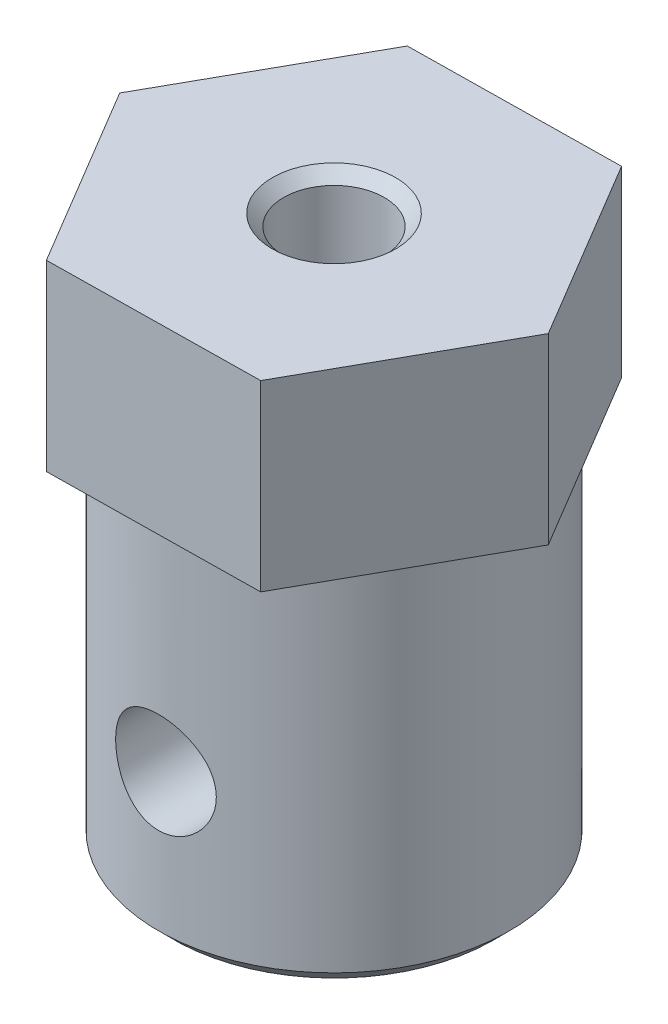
from build123d import *

# Parameters (mm, degrees)
SALIENTE_EXTRUIR1_DEPTH         = 6
TALADRO_ROSCADO_M41_D           = 3.3
TALADRO_ROSCADO_M41_CSINK_D     = 4.05
TALADRO_ROSCADO_M41_CSINK_ANGLE = 90
CROQUIS4_R                      = 5.75
CROQUIS4_R_2                    = 3
SALIENTE_EXTRUIR2_DEPTH         = 12
CHAFL_N1_SIZE                   = 0.5


with BuildPart() as part:
    # Croquis1 → Saliente-Extruir1 (new body)
    with BuildSketch(Plane(origin=(0, 0, 0), x_dir=(1, 0, 0), z_dir=(0, 1, 0))):
        Polygon((-3.547687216, 5.950959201), (-6.927525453, -0.096907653), (-3.379838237, -6.047866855), (3.547687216, -5.950959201), (6.927525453, 0.096907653), (3.379838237, 6.047866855), align=None)
    extrude(amount=SALIENTE_EXTRUIR1_DEPTH)

    # Taladro roscado M41 (through all)
    with Locations(Plane(origin=(0, 6, 0), x_dir=(1, 0, 0), z_dir=(0, 1, 0))):
        with Locations((0, 0)):
            CounterSinkHole(TALADRO_ROSCADO_M41_D / 2, TALADRO_ROSCADO_M41_CSINK_D / 2, counter_sink_angle=TALADRO_ROSCADO_M41_CSINK_ANGLE)

    # Croquis4 → Saliente-Extruir2 (add)
    with BuildSketch(Plane.XZ):
        with Locations(Location((0, 0, 0), (0, 0, 270))):
            Circle(CROQUIS4_R)
        with Locations(Location((0, 0, 0), (0, 0, 270))):
            Circle(CROQUIS4_R_2, mode=Mode.SUBTRACT)
    extrude(amount=SALIENTE_EXTRUIR2_DEPTH)

    # Croquis7 → Taladro roscado M42 (revolve, cut)
    with BuildSketch(Plane(origin=(0, -7, 0), x_dir=(0, 1, 0), z_dir=(1, 0, 0))):
        Polygon((0, 0), (0, 6.047866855), (1.65, 6.047866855), (1.65, 0.375), (2.025, 0), align=None)
    revolve(axis=Axis((0, -7, -6.35), (0, 0, 1)), mode=Mode.SUBTRACT)

    # Chafl_n1
    chafl_n1_edges = [part.edges().sort_by_distance(p)[0] for p in [
        (0, -12, 5.75),
        (0, -12, 3),
    ]]
    chamfer(chafl_n1_edges, length=CHAFL_N1_SIZE)


solid = part.part
